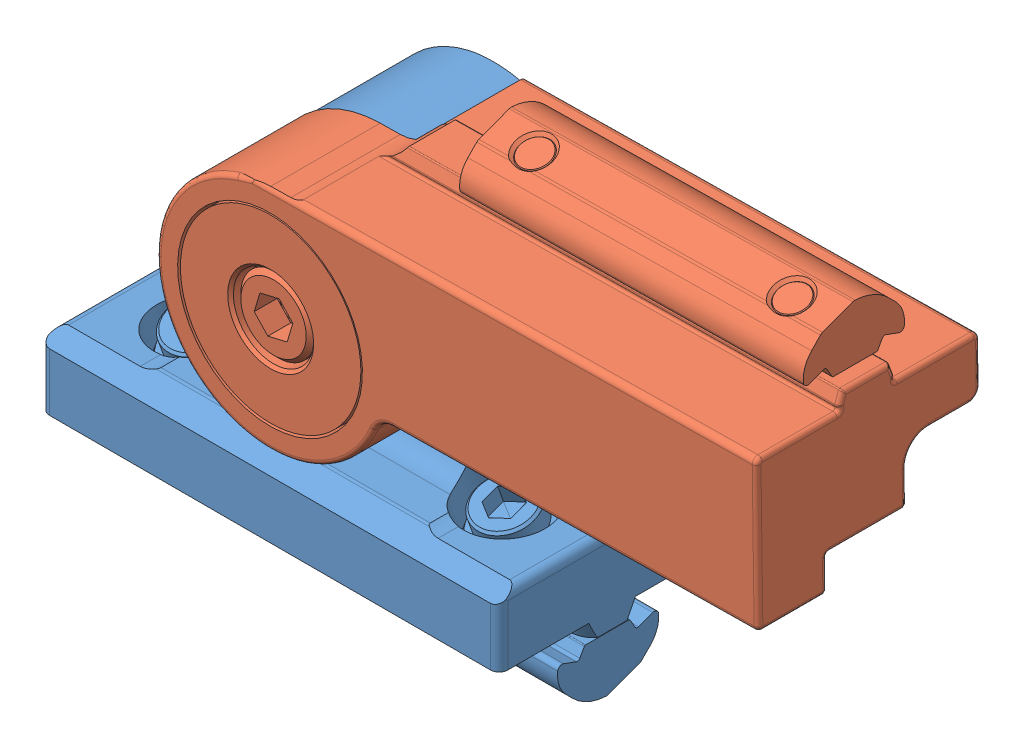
SolidWorks assembly 40mm Adjustable Angle Bracket Profile-Offset Profile Mount.SLDASM, configuration Standard (file format 13000). Lengths in mm.
Overall size (125.5 80.92 39).
2 component instances, 2 part files, 2 mates.
Components (placement in the parent):
- 40mm Adjustable Angle Bracket - Profile Mount -1: 40mm Adjustable Angle Bracket - Profile Mount .SLDPRT [Female] at origin size (80 66.28 39)
- 40mm Adjustable Angle Bracket - Offset Profile Mount Male-1: 40mm Adjustable Angle Bracket - Offset Profile Mount Male.SLDPRT [Standard] at (-0.2709 19.9982 -0.5) x (-0.999908 -0.013547 0) z (0 0 1) size (105.04 52.79 39)
Mates (geometry in assembly coordinates):
- Concentric1: concentric aligned: cylinder of 40mm Adjustable Angle Bracket - Profile Mount -1 through (0 0 2.1058) axis (0 0 1) radius 3.4; cylinder of 40mm Adjustable Angle Bracket - Offset Profile Mount Male-1 through (0 0 50.1429) axis (0 0 1) radius 4
- Coincident1: coincident anti-aligned: plane of 40mm Adjustable Angle Bracket - Profile Mount -1 through (-17.8466 -19.25 -0.5) normal (0 0 1); plane of 40mm Adjustable Angle Bracket - Offset Profile Mount Male-1 through (25.2788 6.343 -0.5) normal (0 0 -1)
